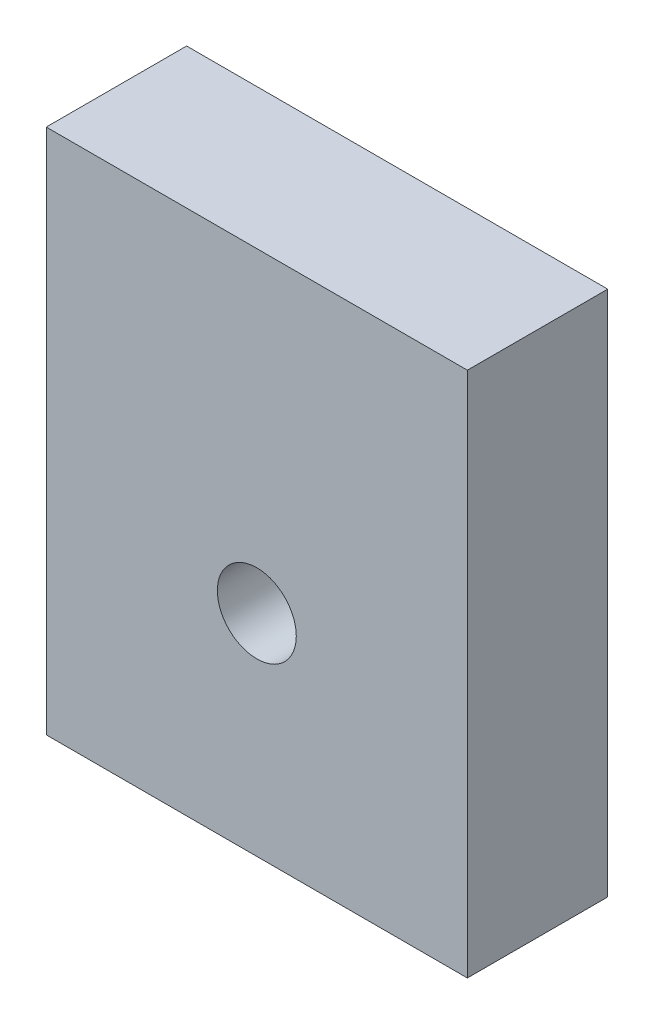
ISO-10303-21;
HEADER;
FILE_DESCRIPTION(('STEP AP214'),'2;1');
FILE_NAME('part.step','',(''),(''),'','','');
FILE_SCHEMA(('AUTOMOTIVE_DESIGN { 1 0 10303 214 1 1 1 1 }'));
ENDSEC;
DATA;
#1=APPLICATION_CONTEXT('core data for automotive mechanical design processes');
#2=APPLICATION_PROTOCOL_DEFINITION('international standard','automotive_design',2000,#1);
#3=PRODUCT_CONTEXT('',#1,'mechanical');
#4=PRODUCT('Part','Part','',(#3));
#5=PRODUCT_RELATED_PRODUCT_CATEGORY('part','',(#4));
#6=PRODUCT_DEFINITION_FORMATION('','',#4);
#7=PRODUCT_DEFINITION_CONTEXT('part definition',#1,'design');
#8=PRODUCT_DEFINITION('design','',#6,#7);
#9=PRODUCT_DEFINITION_SHAPE('','',#8);
#10=(LENGTH_UNIT() NAMED_UNIT(*) SI_UNIT(.MILLI.,.METRE.));
#11=(NAMED_UNIT(*) PLANE_ANGLE_UNIT() SI_UNIT($,.RADIAN.));
#12=(NAMED_UNIT(*) SI_UNIT($,.STERADIAN.) SOLID_ANGLE_UNIT());
#13=UNCERTAINTY_MEASURE_WITH_UNIT(LENGTH_MEASURE(1.E-05),#10,'distance_accuracy_value','');
#14=(GEOMETRIC_REPRESENTATION_CONTEXT(3) GLOBAL_UNCERTAINTY_ASSIGNED_CONTEXT((#13)) GLOBAL_UNIT_ASSIGNED_CONTEXT((#10,
#11,#12)) REPRESENTATION_CONTEXT('',''));
#15=CARTESIAN_POINT('',(0.,0.,0.));
#16=DIRECTION('',(0.,0.,1.));
#17=DIRECTION('',(1.,0.,0.));
#18=AXIS2_PLACEMENT_3D('',#15,#16,#17);
#19=CARTESIAN_POINT('',(-59.8982143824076,190.5,-13.9304614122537));
#20=DIRECTION('',(1.,0.,0.));
#21=DIRECTION('',(0.,0.,-1.));
#22=AXIS2_PLACEMENT_3D('',#19,#20,#21);
#23=PLANE('',#22);
#24=DIRECTION('',(0.,0.,1.));
#25=VECTOR('',#24,1.);
#26=CARTESIAN_POINT('',(-59.8982143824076,0.,-13.9304614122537));
#27=LINE('',#26,#25);
#28=CARTESIAN_POINT('',(-59.8982143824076,0.,-13.9304614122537));
#29=VERTEX_POINT('',#28);
#30=CARTESIAN_POINT('',(-59.8982143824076,0.,36.8695385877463));
#31=VERTEX_POINT('',#30);
#32=EDGE_CURVE('E95',#29,#31,#27,.T.);
#33=ORIENTED_EDGE('',*,*,#32,.T.);
#34=DIRECTION('',(0.,-1.,0.));
#35=VECTOR('',#34,1.);
#36=CARTESIAN_POINT('',(-59.8982143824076,190.5,36.8695385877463));
#37=LINE('',#36,#35);
#38=CARTESIAN_POINT('',(-59.8982143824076,190.5,36.8695385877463));
#39=VERTEX_POINT('',#38);
#40=EDGE_CURVE('E11',#39,#31,#37,.T.);
#41=ORIENTED_EDGE('',*,*,#40,.F.);
#42=DIRECTION('',(0.,0.,1.));
#43=VECTOR('',#42,1.);
#44=CARTESIAN_POINT('',(-59.8982143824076,190.5,-13.9304614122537));
#45=LINE('',#44,#43);
#46=CARTESIAN_POINT('',(-59.8982143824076,190.5,-13.9304614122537));
#47=VERTEX_POINT('',#46);
#48=EDGE_CURVE('E83',#47,#39,#45,.T.);
#49=ORIENTED_EDGE('',*,*,#48,.F.);
#50=DIRECTION('',(0.,-1.,0.));
#51=VECTOR('',#50,1.);
#52=CARTESIAN_POINT('',(-59.8982143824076,190.5,-13.9304614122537));
#53=LINE('',#52,#51);
#54=EDGE_CURVE('E91',#47,#29,#53,.T.);
#55=ORIENTED_EDGE('',*,*,#54,.T.);
#56=EDGE_LOOP('',(#33,#41,#49,#55));
#57=FACE_BOUND('',#56,.T.);
#58=ADVANCED_FACE('F32',(#57),#23,.F.);
#59=CARTESIAN_POINT('',(-59.8982143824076,190.5,36.8695385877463));
#60=DIRECTION('',(0.,0.,-1.));
#61=DIRECTION('',(-1.,0.,0.));
#62=AXIS2_PLACEMENT_3D('',#59,#60,#61);
#63=PLANE('',#62);
#64=CARTESIAN_POINT('',(16.3017856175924,76.2,36.8695385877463));
#65=DIRECTION('',(0.,0.,1.));
#66=DIRECTION('',(1.,0.,0.));
#67=AXIS2_PLACEMENT_3D('',#64,#65,#66);
#68=CIRCLE('',#67,14.2875);
#69=CARTESIAN_POINT('',(30.5892856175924,76.2,36.8695385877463));
#70=VERTEX_POINT('',#69);
#71=EDGE_CURVE('E111',#70,#70,#68,.T.);
#72=ORIENTED_EDGE('',*,*,#71,.F.);
#73=EDGE_LOOP('',(#72));
#74=FACE_BOUND('',#73,.T.);
#75=DIRECTION('',(1.,0.,0.));
#76=VECTOR('',#75,1.);
#77=CARTESIAN_POINT('',(-59.8982143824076,0.,36.8695385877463));
#78=LINE('',#77,#76);
#79=CARTESIAN_POINT('',(92.5017856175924,0.,36.8695385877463));
#80=VERTEX_POINT('',#79);
#81=EDGE_CURVE('E87',#31,#80,#78,.T.);
#82=ORIENTED_EDGE('',*,*,#81,.T.);
#83=DIRECTION('',(0.,-1.,0.));
#84=VECTOR('',#83,1.);
#85=CARTESIAN_POINT('',(92.5017856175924,190.5,36.8695385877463));
#86=LINE('',#85,#84);
#87=CARTESIAN_POINT('',(92.5017856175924,190.5,36.8695385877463));
#88=VERTEX_POINT('',#87);
#89=EDGE_CURVE('E40',#88,#80,#86,.T.);
#90=ORIENTED_EDGE('',*,*,#89,.F.);
#91=DIRECTION('',(1.,0.,0.));
#92=VECTOR('',#91,1.);
#93=CARTESIAN_POINT('',(-59.8982143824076,190.5,36.8695385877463));
#94=LINE('',#93,#92);
#95=EDGE_CURVE('E78',#39,#88,#94,.T.);
#96=ORIENTED_EDGE('',*,*,#95,.F.);
#97=ORIENTED_EDGE('',*,*,#40,.T.);
#98=EDGE_LOOP('',(#82,#90,#96,#97));
#99=FACE_BOUND('',#98,.T.);
#100=ADVANCED_FACE('F86',(#74,#99),#63,.F.);
#101=CARTESIAN_POINT('',(92.5017856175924,190.5,-13.9304614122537));
#102=DIRECTION('',(-1.,0.,0.));
#103=DIRECTION('',(0.,0.,1.));
#104=AXIS2_PLACEMENT_3D('',#101,#102,#103);
#105=PLANE('',#104);
#106=DIRECTION('',(0.,0.,-1.));
#107=VECTOR('',#106,1.);
#108=CARTESIAN_POINT('',(92.5017856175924,0.,-13.9304614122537));
#109=LINE('',#108,#107);
#110=CARTESIAN_POINT('',(92.5017856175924,0.,-13.9304614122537));
#111=VERTEX_POINT('',#110);
#112=EDGE_CURVE('E65',#80,#111,#109,.T.);
#113=ORIENTED_EDGE('',*,*,#112,.T.);
#114=DIRECTION('',(0.,-1.,0.));
#115=VECTOR('',#114,1.);
#116=CARTESIAN_POINT('',(92.5017856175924,190.5,-13.9304614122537));
#117=LINE('',#116,#115);
#118=CARTESIAN_POINT('',(92.5017856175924,190.5,-13.9304614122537));
#119=VERTEX_POINT('',#118);
#120=EDGE_CURVE('E88',#119,#111,#117,.T.);
#121=ORIENTED_EDGE('',*,*,#120,.F.);
#122=DIRECTION('',(0.,0.,-1.));
#123=VECTOR('',#122,1.);
#124=CARTESIAN_POINT('',(92.5017856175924,190.5,-13.9304614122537));
#125=LINE('',#124,#123);
#126=EDGE_CURVE('E81',#88,#119,#125,.T.);
#127=ORIENTED_EDGE('',*,*,#126,.F.);
#128=ORIENTED_EDGE('',*,*,#89,.T.);
#129=EDGE_LOOP('',(#113,#121,#127,#128));
#130=FACE_BOUND('',#129,.T.);
#131=ADVANCED_FACE('F89',(#130),#105,.F.);
#132=CARTESIAN_POINT('',(-59.8982143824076,190.5,-13.9304614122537));
#133=DIRECTION('',(0.,0.,1.));
#134=DIRECTION('',(1.,0.,0.));
#135=AXIS2_PLACEMENT_3D('',#132,#133,#134);
#136=PLANE('',#135);
#137=CARTESIAN_POINT('',(16.3017856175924,76.2,-13.9304614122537));
#138=DIRECTION('',(0.,0.,1.));
#139=DIRECTION('',(1.,0.,0.));
#140=AXIS2_PLACEMENT_3D('',#137,#138,#139);
#141=CIRCLE('',#140,14.2875);
#142=CARTESIAN_POINT('',(30.5892856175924,76.2,-13.9304614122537));
#143=VERTEX_POINT('',#142);
#144=EDGE_CURVE('E98',#143,#143,#141,.T.);
#145=ORIENTED_EDGE('',*,*,#144,.T.);
#146=EDGE_LOOP('',(#145));
#147=FACE_BOUND('',#146,.T.);
#148=DIRECTION('',(-1.,0.,0.));
#149=VECTOR('',#148,1.);
#150=CARTESIAN_POINT('',(-59.8982143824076,0.,-13.9304614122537));
#151=LINE('',#150,#149);
#152=EDGE_CURVE('E71',#111,#29,#151,.T.);
#153=ORIENTED_EDGE('',*,*,#152,.T.);
#154=ORIENTED_EDGE('',*,*,#54,.F.);
#155=DIRECTION('',(-1.,0.,0.));
#156=VECTOR('',#155,1.);
#157=CARTESIAN_POINT('',(-59.8982143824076,190.5,-13.9304614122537));
#158=LINE('',#157,#156);
#159=EDGE_CURVE('E48',#119,#47,#158,.T.);
#160=ORIENTED_EDGE('',*,*,#159,.F.);
#161=ORIENTED_EDGE('',*,*,#120,.T.);
#162=EDGE_LOOP('',(#153,#154,#160,#161));
#163=FACE_BOUND('',#162,.T.);
#164=ADVANCED_FACE('F103',(#147,#163),#136,.F.);
#165=CARTESIAN_POINT('',(0.,190.5,0.));
#166=DIRECTION('',(0.,1.,0.));
#167=DIRECTION('',(0.,0.,1.));
#168=AXIS2_PLACEMENT_3D('',#165,#166,#167);
#169=PLANE('',#168);
#170=ORIENTED_EDGE('',*,*,#48,.T.);
#171=ORIENTED_EDGE('',*,*,#95,.T.);
#172=ORIENTED_EDGE('',*,*,#126,.T.);
#173=ORIENTED_EDGE('',*,*,#159,.T.);
#174=EDGE_LOOP('',(#170,#171,#172,#173));
#175=FACE_BOUND('',#174,.T.);
#176=ADVANCED_FACE('F79',(#175),#169,.T.);
#177=CARTESIAN_POINT('',(0.,0.,0.));
#178=DIRECTION('',(0.,1.,0.));
#179=DIRECTION('',(0.,0.,1.));
#180=AXIS2_PLACEMENT_3D('',#177,#178,#179);
#181=PLANE('',#180);
#182=ORIENTED_EDGE('',*,*,#32,.F.);
#183=ORIENTED_EDGE('',*,*,#152,.F.);
#184=ORIENTED_EDGE('',*,*,#112,.F.);
#185=ORIENTED_EDGE('',*,*,#81,.F.);
#186=EDGE_LOOP('',(#182,#183,#184,#185));
#187=FACE_BOUND('',#186,.T.);
#188=ADVANCED_FACE('F106',(#187),#181,.F.);
#189=CARTESIAN_POINT('',(16.3017856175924,76.2,36.8695385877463));
#190=DIRECTION('',(0.,0.,1.));
#191=DIRECTION('',(1.,0.,0.));
#192=AXIS2_PLACEMENT_3D('',#189,#190,#191);
#193=CYLINDRICAL_SURFACE('',#192,14.2875);
#194=ORIENTED_EDGE('',*,*,#144,.F.);
#195=EDGE_LOOP('',(#194));
#196=FACE_BOUND('',#195,.T.);
#197=ORIENTED_EDGE('',*,*,#71,.T.);
#198=EDGE_LOOP('',(#197));
#199=FACE_BOUND('',#198,.T.);
#200=ADVANCED_FACE('F115',(#196,#199),#193,.F.);
#201=CLOSED_SHELL('',(#58,#100,#131,#164,#176,#188,#200));
#202=MANIFOLD_SOLID_BREP('B2',#201);
#203=ADVANCED_BREP_SHAPE_REPRESENTATION('',(#18,#202),#14);
#204=SHAPE_DEFINITION_REPRESENTATION(#9,#203);
ENDSEC;
END-ISO-10303-21;
